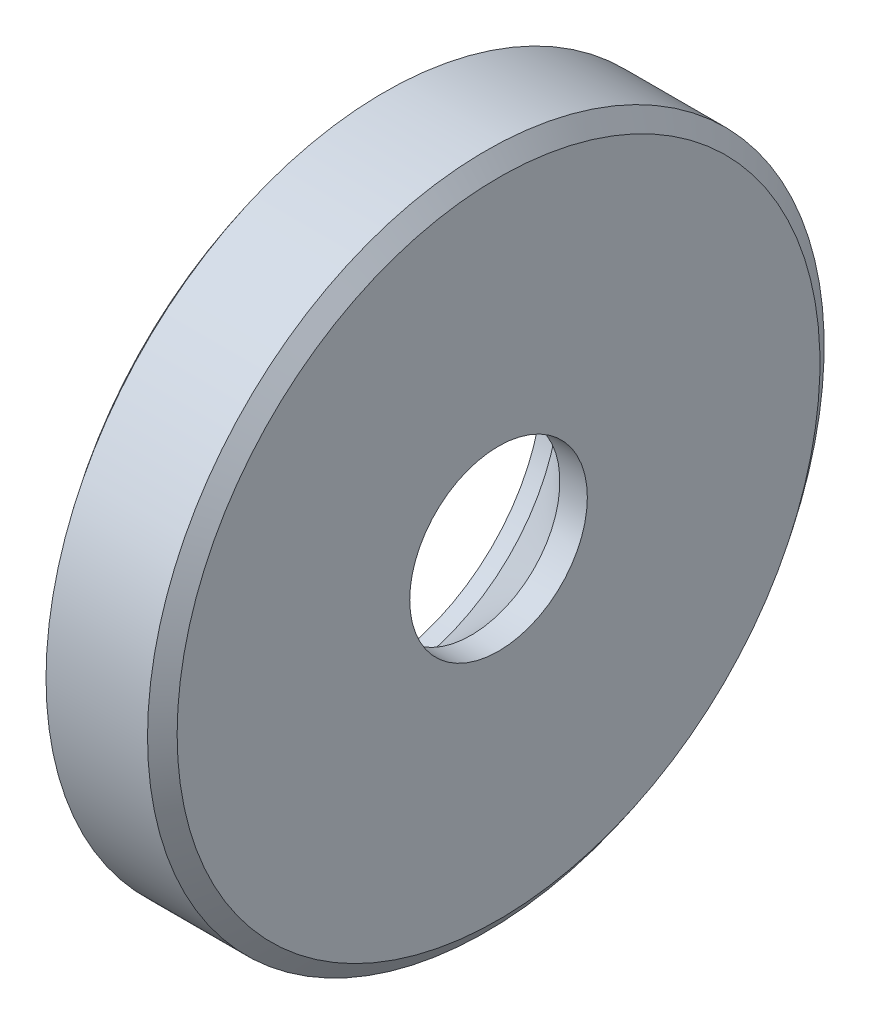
ISO-10303-21;
HEADER;
FILE_DESCRIPTION(('STEP AP214'),'2;1');
FILE_NAME('part.step','',(''),(''),'','','');
FILE_SCHEMA(('AUTOMOTIVE_DESIGN { 1 0 10303 214 1 1 1 1 }'));
ENDSEC;
DATA;
#1=APPLICATION_CONTEXT('core data for automotive mechanical design processes');
#2=APPLICATION_PROTOCOL_DEFINITION('international standard','automotive_design',2000,#1);
#3=PRODUCT_CONTEXT('',#1,'mechanical');
#4=PRODUCT('Part','Part','',(#3));
#5=PRODUCT_RELATED_PRODUCT_CATEGORY('part','',(#4));
#6=PRODUCT_DEFINITION_FORMATION('','',#4);
#7=PRODUCT_DEFINITION_CONTEXT('part definition',#1,'design');
#8=PRODUCT_DEFINITION('design','',#6,#7);
#9=PRODUCT_DEFINITION_SHAPE('','',#8);
#10=(LENGTH_UNIT() NAMED_UNIT(*) SI_UNIT(.MILLI.,.METRE.));
#11=(NAMED_UNIT(*) PLANE_ANGLE_UNIT() SI_UNIT($,.RADIAN.));
#12=(NAMED_UNIT(*) SI_UNIT($,.STERADIAN.) SOLID_ANGLE_UNIT());
#13=UNCERTAINTY_MEASURE_WITH_UNIT(LENGTH_MEASURE(1.E-05),#10,'distance_accuracy_value','');
#14=(GEOMETRIC_REPRESENTATION_CONTEXT(3) GLOBAL_UNCERTAINTY_ASSIGNED_CONTEXT((#13)) GLOBAL_UNIT_ASSIGNED_CONTEXT((#10,
#11,#12)) REPRESENTATION_CONTEXT('',''));
#15=CARTESIAN_POINT('',(0.,0.,0.));
#16=DIRECTION('',(0.,0.,1.));
#17=DIRECTION('',(1.,0.,0.));
#18=AXIS2_PLACEMENT_3D('',#15,#16,#17);
#19=CARTESIAN_POINT('',(-145.,119.600000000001,184.));
#20=DIRECTION('',(1.,0.,0.));
#21=DIRECTION('',(0.,0.,-1.));
#22=AXIS2_PLACEMENT_3D('',#19,#20,#21);
#23=PLANE('',#22);
#24=CARTESIAN_POINT('',(-145.,112.000000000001,184.));
#25=DIRECTION('',(-1.,0.,0.));
#26=DIRECTION('',(0.,0.,1.));
#27=AXIS2_PLACEMENT_3D('',#24,#25,#26);
#28=CIRCLE('',#27,7.6);
#29=CARTESIAN_POINT('',(-145.,112.000000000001,191.600000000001));
#30=VERTEX_POINT('',#29);
#31=EDGE_CURVE('E10',#30,#30,#28,.T.);
#32=ORIENTED_EDGE('',*,*,#31,.F.);
#33=EDGE_LOOP('',(#32));
#34=FACE_BOUND('',#33,.T.);
#35=CARTESIAN_POINT('',(-145.,112.000000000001,184.));
#36=DIRECTION('',(1.,0.,0.));
#37=DIRECTION('',(0.,0.,-1.));
#38=AXIS2_PLACEMENT_3D('',#35,#36,#37);
#39=CIRCLE('',#38,2.1);
#40=CARTESIAN_POINT('',(-145.,112.000000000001,181.9));
#41=VERTEX_POINT('',#40);
#42=EDGE_CURVE('E41',#41,#41,#39,.F.);
#43=ORIENTED_EDGE('',*,*,#42,.T.);
#44=EDGE_LOOP('',(#43));
#45=FACE_BOUND('',#44,.T.);
#46=ADVANCED_FACE('F26',(#34,#45),#23,.T.);
#47=CARTESIAN_POINT('',(-148.,112.000000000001,184.));
#48=DIRECTION('',(-1.,0.,0.));
#49=DIRECTION('',(0.,0.,1.));
#50=AXIS2_PLACEMENT_3D('',#47,#48,#49);
#51=PLANE('',#50);
#52=CARTESIAN_POINT('',(-148.,112.000000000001,184.));
#53=DIRECTION('',(-1.,0.,0.));
#54=DIRECTION('',(0.,0.,1.));
#55=AXIS2_PLACEMENT_3D('',#52,#53,#54);
#56=CIRCLE('',#55,7.6);
#57=CARTESIAN_POINT('',(-148.,112.000000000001,191.600000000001));
#58=VERTEX_POINT('',#57);
#59=EDGE_CURVE('E43',#58,#58,#56,.T.);
#60=ORIENTED_EDGE('',*,*,#59,.T.);
#61=EDGE_LOOP('',(#60));
#62=FACE_BOUND('',#61,.T.);
#63=CARTESIAN_POINT('',(-148.,112.000000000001,184.));
#64=DIRECTION('',(-1.,0.,0.));
#65=DIRECTION('',(0.,0.,1.));
#66=AXIS2_PLACEMENT_3D('',#63,#64,#65);
#67=CIRCLE('',#66,4.05);
#68=CARTESIAN_POINT('',(-148.,112.000000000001,188.050000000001));
#69=VERTEX_POINT('',#68);
#70=EDGE_CURVE('E44',#69,#69,#67,.T.);
#71=ORIENTED_EDGE('',*,*,#70,.F.);
#72=EDGE_LOOP('',(#71));
#73=FACE_BOUND('',#72,.T.);
#74=ADVANCED_FACE('F73',(#62,#73),#51,.T.);
#75=CARTESIAN_POINT('',(-145.3,112.000000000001,184.));
#76=DIRECTION('',(-1.,0.,0.));
#77=DIRECTION('',(0.,0.,1.));
#78=AXIS2_PLACEMENT_3D('',#75,#76,#77);
#79=CONICAL_SURFACE('',#78,8.,0.927295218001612);
#80=ORIENTED_EDGE('',*,*,#31,.T.);
#81=EDGE_LOOP('',(#80));
#82=FACE_BOUND('',#81,.T.);
#83=CARTESIAN_POINT('',(-145.3,112.000000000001,184.));
#84=DIRECTION('',(-1.,0.,0.));
#85=DIRECTION('',(0.,0.,1.));
#86=AXIS2_PLACEMENT_3D('',#83,#84,#85);
#87=CIRCLE('',#86,8.);
#88=CARTESIAN_POINT('',(-145.3,112.000000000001,192.000000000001));
#89=VERTEX_POINT('',#88);
#90=EDGE_CURVE('E33',#89,#89,#87,.T.);
#91=ORIENTED_EDGE('',*,*,#90,.F.);
#92=EDGE_LOOP('',(#91));
#93=FACE_BOUND('',#92,.T.);
#94=ADVANCED_FACE('F64',(#82,#93),#79,.T.);
#95=CARTESIAN_POINT('',(-148.,112.000000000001,184.));
#96=DIRECTION('',(-1.,0.,0.));
#97=DIRECTION('',(0.,0.,1.));
#98=AXIS2_PLACEMENT_3D('',#95,#96,#97);
#99=CYLINDRICAL_SURFACE('',#98,8.);
#100=ORIENTED_EDGE('',*,*,#90,.T.);
#101=EDGE_LOOP('',(#100));
#102=FACE_BOUND('',#101,.T.);
#103=CARTESIAN_POINT('',(-147.7,112.000000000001,184.));
#104=DIRECTION('',(-1.,0.,0.));
#105=DIRECTION('',(0.,0.,1.));
#106=AXIS2_PLACEMENT_3D('',#103,#104,#105);
#107=CIRCLE('',#106,8.);
#108=CARTESIAN_POINT('',(-147.7,112.000000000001,192.000000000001));
#109=VERTEX_POINT('',#108);
#110=EDGE_CURVE('E38',#109,#109,#107,.T.);
#111=ORIENTED_EDGE('',*,*,#110,.F.);
#112=EDGE_LOOP('',(#111));
#113=FACE_BOUND('',#112,.T.);
#114=ADVANCED_FACE('F62',(#102,#113),#99,.T.);
#115=CARTESIAN_POINT('',(-148.,112.000000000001,184.));
#116=DIRECTION('',(1.,0.,0.));
#117=DIRECTION('',(0.,0.,-1.));
#118=AXIS2_PLACEMENT_3D('',#115,#116,#117);
#119=CONICAL_SURFACE('',#118,7.6,0.927295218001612);
#120=ORIENTED_EDGE('',*,*,#110,.T.);
#121=EDGE_LOOP('',(#120));
#122=FACE_BOUND('',#121,.T.);
#123=ORIENTED_EDGE('',*,*,#59,.F.);
#124=EDGE_LOOP('',(#123));
#125=FACE_BOUND('',#124,.T.);
#126=ADVANCED_FACE('F59',(#122,#125),#119,.T.);
#127=CARTESIAN_POINT('',(-148.,112.000000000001,184.));
#128=DIRECTION('',(-1.,0.,0.));
#129=DIRECTION('',(0.,0.,1.));
#130=AXIS2_PLACEMENT_3D('',#127,#128,#129);
#131=CYLINDRICAL_SURFACE('',#130,4.05);
#132=ORIENTED_EDGE('',*,*,#70,.T.);
#133=EDGE_LOOP('',(#132));
#134=FACE_BOUND('',#133,.T.);
#135=CARTESIAN_POINT('',(-147.6,112.000000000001,184.));
#136=DIRECTION('',(-1.,0.,0.));
#137=DIRECTION('',(0.,0.,1.));
#138=AXIS2_PLACEMENT_3D('',#135,#136,#137);
#139=CIRCLE('',#138,4.04999999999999);
#140=CARTESIAN_POINT('',(-147.6,112.000000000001,188.05));
#141=VERTEX_POINT('',#140);
#142=EDGE_CURVE('E54',#141,#141,#139,.T.);
#143=ORIENTED_EDGE('',*,*,#142,.F.);
#144=EDGE_LOOP('',(#143));
#145=FACE_BOUND('',#144,.T.);
#146=ADVANCED_FACE('F71',(#134,#145),#131,.F.);
#147=CARTESIAN_POINT('',(-148.,112.000000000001,184.));
#148=DIRECTION('',(-1.,0.,0.));
#149=DIRECTION('',(0.,0.,1.));
#150=AXIS2_PLACEMENT_3D('',#147,#148,#149);
#151=CYLINDRICAL_SURFACE('',#150,2.1);
#152=CARTESIAN_POINT('',(-145.65,112.000000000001,184.));
#153=DIRECTION('',(-1.,0.,0.));
#154=DIRECTION('',(0.,0.,1.));
#155=AXIS2_PLACEMENT_3D('',#152,#153,#154);
#156=CIRCLE('',#155,2.1);
#157=CARTESIAN_POINT('',(-145.65,112.000000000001,186.100000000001));
#158=VERTEX_POINT('',#157);
#159=EDGE_CURVE('E29',#158,#158,#156,.F.);
#160=ORIENTED_EDGE('',*,*,#159,.F.);
#161=EDGE_LOOP('',(#160));
#162=FACE_BOUND('',#161,.T.);
#163=ORIENTED_EDGE('',*,*,#42,.F.);
#164=EDGE_LOOP('',(#163));
#165=FACE_BOUND('',#164,.T.);
#166=ADVANCED_FACE('F87',(#162,#165),#151,.F.);
#167=CARTESIAN_POINT('',(-147.6,112.000000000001,184.));
#168=DIRECTION('',(-1.,0.,0.));
#169=DIRECTION('',(0.,0.,1.));
#170=AXIS2_PLACEMENT_3D('',#167,#168,#169);
#171=CONICAL_SURFACE('',#170,4.04999999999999,0.78539816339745);
#172=ORIENTED_EDGE('',*,*,#159,.T.);
#173=EDGE_LOOP('',(#172));
#174=FACE_BOUND('',#173,.T.);
#175=ORIENTED_EDGE('',*,*,#142,.T.);
#176=EDGE_LOOP('',(#175));
#177=FACE_BOUND('',#176,.T.);
#178=ADVANCED_FACE('F90',(#174,#177),#171,.F.);
#179=CLOSED_SHELL('',(#46,#74,#94,#114,#126,#146,#166,#178));
#180=MANIFOLD_SOLID_BREP('B2',#179);
#181=ADVANCED_BREP_SHAPE_REPRESENTATION('',(#18,#180),#14);
#182=SHAPE_DEFINITION_REPRESENTATION(#9,#181);
ENDSEC;
END-ISO-10303-21;
